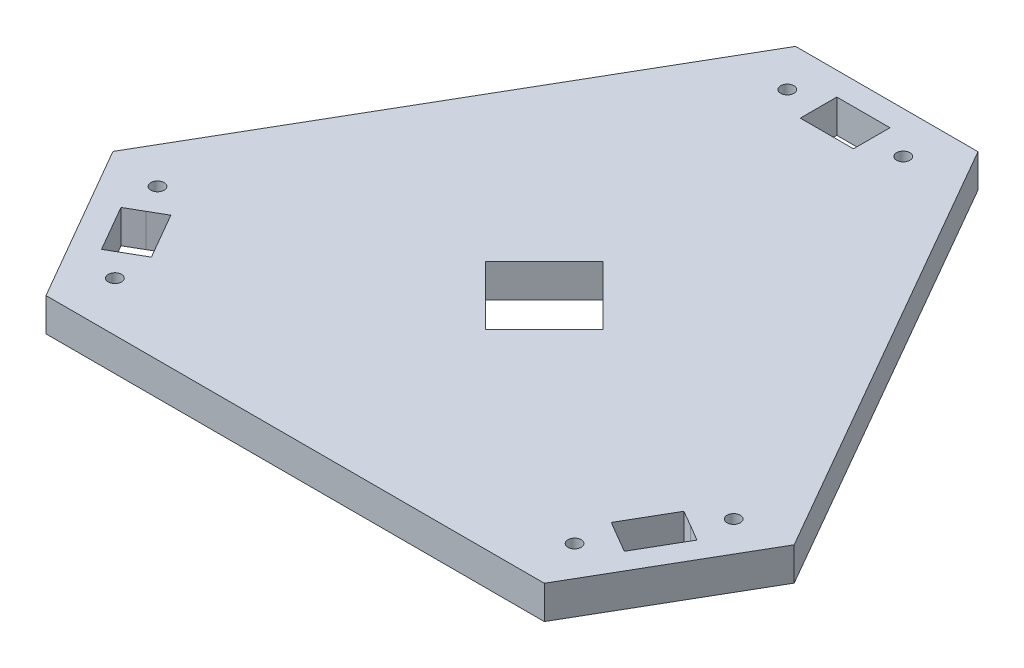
ISO-10303-21;
HEADER;
FILE_DESCRIPTION(('STEP AP214'),'2;1');
FILE_NAME('part.step','',(''),(''),'','','');
FILE_SCHEMA(('AUTOMOTIVE_DESIGN { 1 0 10303 214 1 1 1 1 }'));
ENDSEC;
DATA;
#1=APPLICATION_CONTEXT('core data for automotive mechanical design processes');
#2=APPLICATION_PROTOCOL_DEFINITION('international standard','automotive_design',2000,#1);
#3=PRODUCT_CONTEXT('',#1,'mechanical');
#4=PRODUCT('Part','Part','',(#3));
#5=PRODUCT_RELATED_PRODUCT_CATEGORY('part','',(#4));
#6=PRODUCT_DEFINITION_FORMATION('','',#4);
#7=PRODUCT_DEFINITION_CONTEXT('part definition',#1,'design');
#8=PRODUCT_DEFINITION('design','',#6,#7);
#9=PRODUCT_DEFINITION_SHAPE('','',#8);
#10=(LENGTH_UNIT() NAMED_UNIT(*) SI_UNIT(.MILLI.,.METRE.));
#11=(NAMED_UNIT(*) PLANE_ANGLE_UNIT() SI_UNIT($,.RADIAN.));
#12=(NAMED_UNIT(*) SI_UNIT($,.STERADIAN.) SOLID_ANGLE_UNIT());
#13=UNCERTAINTY_MEASURE_WITH_UNIT(LENGTH_MEASURE(1.E-05),#10,'distance_accuracy_value','');
#14=(GEOMETRIC_REPRESENTATION_CONTEXT(3) GLOBAL_UNCERTAINTY_ASSIGNED_CONTEXT((#13)) GLOBAL_UNIT_ASSIGNED_CONTEXT((#10,
#11,#12)) REPRESENTATION_CONTEXT('',''));
#15=CARTESIAN_POINT('',(0.,0.,0.));
#16=DIRECTION('',(0.,0.,1.));
#17=DIRECTION('',(1.,0.,0.));
#18=AXIS2_PLACEMENT_3D('',#15,#16,#17);
#19=CARTESIAN_POINT('',(-54.2371764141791,20.,-355.613027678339));
#20=DIRECTION('',(0.,0.,-1.));
#21=DIRECTION('',(-1.,0.,0.));
#22=AXIS2_PLACEMENT_3D('',#19,#20,#21);
#23=PLANE('',#22);
#24=DIRECTION('',(1.,0.,0.));
#25=VECTOR('',#24,1.);
#26=CARTESIAN_POINT('',(-54.2371764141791,0.,-355.613027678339));
#27=LINE('',#26,#25);
#28=CARTESIAN_POINT('',(-54.2371764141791,0.,-355.613027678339));
#29=VERTEX_POINT('',#28);
#30=CARTESIAN_POINT('',(55.5843421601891,0.,-355.613027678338));
#31=VERTEX_POINT('',#30);
#32=EDGE_CURVE('E395',#29,#31,#27,.T.);
#33=ORIENTED_EDGE('',*,*,#32,.F.);
#34=DIRECTION('',(0.,-1.,0.));
#35=VECTOR('',#34,1.);
#36=CARTESIAN_POINT('',(-54.2371764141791,20.,-355.613027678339));
#37=LINE('',#36,#35);
#38=CARTESIAN_POINT('',(-54.2371764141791,20.,-355.613027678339));
#39=VERTEX_POINT('',#38);
#40=EDGE_CURVE('E11',#39,#29,#37,.T.);
#41=ORIENTED_EDGE('',*,*,#40,.F.);
#42=DIRECTION('',(1.,0.,0.));
#43=VECTOR('',#42,1.);
#44=CARTESIAN_POINT('',(-54.2371764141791,20.,-355.613027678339));
#45=LINE('',#44,#43);
#46=CARTESIAN_POINT('',(55.5843421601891,20.,-355.613027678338));
#47=VERTEX_POINT('',#46);
#48=EDGE_CURVE('E406',#39,#47,#45,.T.);
#49=ORIENTED_EDGE('',*,*,#48,.T.);
#50=DIRECTION('',(0.,-1.,0.));
#51=VECTOR('',#50,1.);
#52=CARTESIAN_POINT('',(55.5843421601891,20.,-355.613027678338));
#53=LINE('',#52,#51);
#54=EDGE_CURVE('E35',#47,#31,#53,.T.);
#55=ORIENTED_EDGE('',*,*,#54,.T.);
#56=EDGE_LOOP('',(#33,#41,#49,#55));
#57=FACE_BOUND('',#56,.T.);
#58=ADVANCED_FACE('F32',(#57),#23,.T.);
#59=CARTESIAN_POINT('',(-54.2371764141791,20.,-355.613027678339));
#60=DIRECTION('',(0.865353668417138,0.,0.501161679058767));
#61=DIRECTION('',(0.501161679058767,0.,-0.865353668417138));
#62=AXIS2_PLACEMENT_3D('',#59,#60,#61);
#63=PLANE('',#62);
#64=DIRECTION('',(-0.501161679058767,0.,0.865353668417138));
#65=VECTOR('',#64,1.);
#66=CARTESIAN_POINT('',(-54.2371764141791,0.,-355.613027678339));
#67=LINE('',#66,#65);
#68=CARTESIAN_POINT('',(-204.994277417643,0.,-95.3014040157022));
#69=VERTEX_POINT('',#68);
#70=EDGE_CURVE('E410',#29,#69,#67,.T.);
#71=ORIENTED_EDGE('',*,*,#70,.T.);
#72=DIRECTION('',(0.,-1.,0.));
#73=VECTOR('',#72,1.);
#74=CARTESIAN_POINT('',(-204.994277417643,20.,-95.3014040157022));
#75=LINE('',#74,#73);
#76=CARTESIAN_POINT('',(-204.994277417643,20.,-95.3014040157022));
#77=VERTEX_POINT('',#76);
#78=EDGE_CURVE('E40',#77,#69,#75,.T.);
#79=ORIENTED_EDGE('',*,*,#78,.F.);
#80=DIRECTION('',(-0.501161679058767,0.,0.865353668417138));
#81=VECTOR('',#80,1.);
#82=CARTESIAN_POINT('',(-54.2371764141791,20.,-355.613027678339));
#83=LINE('',#82,#81);
#84=EDGE_CURVE('E420',#39,#77,#83,.T.);
#85=ORIENTED_EDGE('',*,*,#84,.F.);
#86=ORIENTED_EDGE('',*,*,#40,.T.);
#87=EDGE_LOOP('',(#71,#79,#85,#86));
#88=FACE_BOUND('',#87,.T.);
#89=ADVANCED_FACE('F458',(#88),#63,.F.);
#90=CARTESIAN_POINT('',(-149.988554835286,20.,0.));
#91=DIRECTION('',(-0.866090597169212,0.,0.499887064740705));
#92=DIRECTION('',(0.499887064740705,0.,0.866090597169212));
#93=AXIS2_PLACEMENT_3D('',#90,#91,#92);
#94=PLANE('',#93);
#95=DIRECTION('',(-0.499887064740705,0.,-0.866090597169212));
#96=VECTOR('',#95,1.);
#97=CARTESIAN_POINT('',(-149.988554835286,0.,0.));
#98=LINE('',#97,#96);
#99=CARTESIAN_POINT('',(-149.988554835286,0.,0.));
#100=VERTEX_POINT('',#99);
#101=EDGE_CURVE('E433',#100,#69,#98,.T.);
#102=ORIENTED_EDGE('',*,*,#101,.F.);
#103=DIRECTION('',(0.,-1.,0.));
#104=VECTOR('',#103,1.);
#105=CARTESIAN_POINT('',(-149.988554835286,20.,0.));
#106=LINE('',#105,#104);
#107=CARTESIAN_POINT('',(-149.988554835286,20.,0.));
#108=VERTEX_POINT('',#107);
#109=EDGE_CURVE('E439',#108,#100,#106,.T.);
#110=ORIENTED_EDGE('',*,*,#109,.F.);
#111=DIRECTION('',(-0.499887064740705,0.,-0.866090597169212));
#112=VECTOR('',#111,1.);
#113=CARTESIAN_POINT('',(-149.988554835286,20.,0.));
#114=LINE('',#113,#112);
#115=EDGE_CURVE('E417',#108,#77,#114,.T.);
#116=ORIENTED_EDGE('',*,*,#115,.T.);
#117=ORIENTED_EDGE('',*,*,#78,.T.);
#118=EDGE_LOOP('',(#102,#110,#116,#117));
#119=FACE_BOUND('',#118,.T.);
#120=ADVANCED_FACE('F470',(#119),#94,.T.);
#121=CARTESIAN_POINT('',(-149.988554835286,20.,0.));
#122=DIRECTION('',(0.,0.,-1.));
#123=DIRECTION('',(-1.,0.,0.));
#124=AXIS2_PLACEMENT_3D('',#121,#122,#123);
#125=PLANE('',#124);
#126=DIRECTION('',(1.,0.,0.));
#127=VECTOR('',#126,1.);
#128=CARTESIAN_POINT('',(-149.988554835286,0.,0.));
#129=LINE('',#128,#127);
#130=CARTESIAN_POINT('',(150.075497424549,0.,0.));
#131=VERTEX_POINT('',#130);
#132=EDGE_CURVE('E430',#100,#131,#129,.T.);
#133=ORIENTED_EDGE('',*,*,#132,.T.);
#134=DIRECTION('',(0.,-1.,0.));
#135=VECTOR('',#134,1.);
#136=CARTESIAN_POINT('',(150.075497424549,20.,0.));
#137=LINE('',#136,#135);
#138=CARTESIAN_POINT('',(150.075497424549,20.,0.));
#139=VERTEX_POINT('',#138);
#140=EDGE_CURVE('E441',#139,#131,#137,.T.);
#141=ORIENTED_EDGE('',*,*,#140,.F.);
#142=DIRECTION('',(1.,0.,0.));
#143=VECTOR('',#142,1.);
#144=CARTESIAN_POINT('',(-149.988554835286,20.,0.));
#145=LINE('',#144,#143);
#146=EDGE_CURVE('E415',#108,#139,#145,.T.);
#147=ORIENTED_EDGE('',*,*,#146,.F.);
#148=ORIENTED_EDGE('',*,*,#109,.T.);
#149=EDGE_LOOP('',(#133,#141,#147,#148));
#150=FACE_BOUND('',#149,.T.);
#151=ADVANCED_FACE('F471',(#150),#125,.F.);
#152=CARTESIAN_POINT('',(205.21826345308,20.,-95.3014040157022));
#153=DIRECTION('',(0.865551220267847,0.,0.500820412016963));
#154=DIRECTION('',(0.500820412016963,0.,-0.865551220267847));
#155=AXIS2_PLACEMENT_3D('',#152,#153,#154);
#156=PLANE('',#155);
#157=DIRECTION('',(-0.500820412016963,0.,0.865551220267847));
#158=VECTOR('',#157,1.);
#159=CARTESIAN_POINT('',(205.21826345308,0.,-95.3014040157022));
#160=LINE('',#159,#158);
#161=CARTESIAN_POINT('',(205.21826345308,0.,-95.3014040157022));
#162=VERTEX_POINT('',#161);
#163=EDGE_CURVE('E427',#162,#131,#160,.T.);
#164=ORIENTED_EDGE('',*,*,#163,.F.);
#165=DIRECTION('',(0.,-1.,0.));
#166=VECTOR('',#165,1.);
#167=CARTESIAN_POINT('',(205.21826345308,20.,-95.3014040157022));
#168=LINE('',#167,#166);
#169=CARTESIAN_POINT('',(205.21826345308,20.,-95.3014040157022));
#170=VERTEX_POINT('',#169);
#171=EDGE_CURVE('E442',#170,#162,#168,.T.);
#172=ORIENTED_EDGE('',*,*,#171,.F.);
#173=DIRECTION('',(-0.500820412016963,0.,0.865551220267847));
#174=VECTOR('',#173,1.);
#175=CARTESIAN_POINT('',(205.21826345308,20.,-95.3014040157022));
#176=LINE('',#175,#174);
#177=EDGE_CURVE('E412',#170,#139,#176,.T.);
#178=ORIENTED_EDGE('',*,*,#177,.T.);
#179=ORIENTED_EDGE('',*,*,#140,.T.);
#180=EDGE_LOOP('',(#164,#172,#178,#179));
#181=FACE_BOUND('',#180,.T.);
#182=ADVANCED_FACE('F467',(#181),#156,.T.);
#183=CARTESIAN_POINT('',(205.21826345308,20.,-95.3014040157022));
#184=DIRECTION('',(-0.866971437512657,0.,0.498357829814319));
#185=DIRECTION('',(0.498357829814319,0.,0.866971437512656));
#186=AXIS2_PLACEMENT_3D('',#183,#184,#185);
#187=PLANE('',#186);
#188=DIRECTION('',(-0.498357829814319,0.,-0.866971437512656));
#189=VECTOR('',#188,1.);
#190=CARTESIAN_POINT('',(205.21826345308,0.,-95.3014040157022));
#191=LINE('',#190,#189);
#192=EDGE_CURVE('E424',#162,#31,#191,.T.);
#193=ORIENTED_EDGE('',*,*,#192,.T.);
#194=ORIENTED_EDGE('',*,*,#54,.F.);
#195=DIRECTION('',(-0.498357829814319,0.,-0.866971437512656));
#196=VECTOR('',#195,1.);
#197=CARTESIAN_POINT('',(205.21826345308,20.,-95.3014040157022));
#198=LINE('',#197,#196);
#199=EDGE_CURVE('E409',#170,#47,#198,.T.);
#200=ORIENTED_EDGE('',*,*,#199,.F.);
#201=ORIENTED_EDGE('',*,*,#171,.T.);
#202=EDGE_LOOP('',(#193,#194,#200,#201));
#203=FACE_BOUND('',#202,.T.);
#204=ADVANCED_FACE('F450',(#203),#187,.F.);
#205=CARTESIAN_POINT('',(0.,20.,0.));
#206=DIRECTION('',(0.,1.,0.));
#207=DIRECTION('',(0.,0.,1.));
#208=AXIS2_PLACEMENT_3D('',#205,#206,#207);
#209=PLANE('',#208);
#210=DIRECTION('',(0.707106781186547,0.,-0.707106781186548));
#211=VECTOR('',#210,1.);
#212=CARTESIAN_POINT('',(0.,20.,-114.796112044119));
#213=LINE('',#212,#211);
#214=CARTESIAN_POINT('',(0.,20.,-114.796112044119));
#215=VERTEX_POINT('',#214);
#216=CARTESIAN_POINT('',(35.355,20.,-150.151112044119));
#217=VERTEX_POINT('',#216);
#218=EDGE_CURVE('E48',#215,#217,#213,.T.);
#219=ORIENTED_EDGE('',*,*,#218,.F.);
#220=DIRECTION('',(0.707106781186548,0.,0.707106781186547));
#221=VECTOR('',#220,1.);
#222=CARTESIAN_POINT('',(0.,20.,-114.796112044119));
#223=LINE('',#222,#221);
#224=CARTESIAN_POINT('',(-35.355,20.,-150.151112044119));
#225=VERTEX_POINT('',#224);
#226=EDGE_CURVE('E223',#225,#215,#223,.T.);
#227=ORIENTED_EDGE('',*,*,#226,.F.);
#228=DIRECTION('',(-0.707106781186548,0.,0.707106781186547));
#229=VECTOR('',#228,1.);
#230=CARTESIAN_POINT('',(-35.355,20.,-150.151112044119));
#231=LINE('',#230,#229);
#232=CARTESIAN_POINT('',(0.,20.,-185.506112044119));
#233=VERTEX_POINT('',#232);
#234=EDGE_CURVE('E226',#233,#225,#231,.T.);
#235=ORIENTED_EDGE('',*,*,#234,.F.);
#236=DIRECTION('',(-0.707106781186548,0.,-0.707106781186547));
#237=VECTOR('',#236,1.);
#238=CARTESIAN_POINT('',(35.355,20.,-150.151112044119));
#239=LINE('',#238,#237);
#240=EDGE_CURVE('E232',#217,#233,#239,.T.);
#241=ORIENTED_EDGE('',*,*,#240,.F.);
#242=EDGE_LOOP('',(#219,#227,#235,#241));
#243=FACE_BOUND('',#242,.T.);
#244=CARTESIAN_POINT('',(-138.33403120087,20.,-29.8189885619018));
#245=DIRECTION('',(0.,1.,0.));
#246=DIRECTION('',(0.,0.,1.));
#247=AXIS2_PLACEMENT_3D('',#244,#245,#246);
#248=CIRCLE('',#247,3.99999999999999);
#249=CARTESIAN_POINT('',(-138.33403120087,20.,-25.8189885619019));
#250=VERTEX_POINT('',#249);
#251=EDGE_CURVE('E238',#250,#250,#248,.T.);
#252=ORIENTED_EDGE('',*,*,#251,.F.);
#253=EDGE_LOOP('',(#252));
#254=FACE_BOUND('',#253,.T.);
#255=CARTESIAN_POINT('',(-173.344271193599,20.,-90.4767686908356));
#256=DIRECTION('',(0.,1.,0.));
#257=DIRECTION('',(0.,0.,1.));
#258=AXIS2_PLACEMENT_3D('',#255,#256,#257);
#259=CIRCLE('',#258,3.99999999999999);
#260=CARTESIAN_POINT('',(-173.344271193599,20.,-86.4767686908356));
#261=VERTEX_POINT('',#260);
#262=EDGE_CURVE('E245',#261,#261,#259,.T.);
#263=ORIENTED_EDGE('',*,*,#262,.F.);
#264=EDGE_LOOP('',(#263));
#265=FACE_BOUND('',#264,.T.);
#266=CARTESIAN_POINT('',(35.5843421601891,20.,-330.613027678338));
#267=DIRECTION('',(0.,1.,0.));
#268=DIRECTION('',(0.,0.,1.));
#269=AXIS2_PLACEMENT_3D('',#266,#267,#268);
#270=CIRCLE('',#269,4.00000000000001);
#271=CARTESIAN_POINT('',(35.5843421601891,20.,-326.613027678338));
#272=VERTEX_POINT('',#271);
#273=EDGE_CURVE('E251',#272,#272,#270,.T.);
#274=ORIENTED_EDGE('',*,*,#273,.F.);
#275=EDGE_LOOP('',(#274));
#276=FACE_BOUND('',#275,.T.);
#277=CARTESIAN_POINT('',(-34.2371764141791,20.,-330.613027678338));
#278=DIRECTION('',(0.,1.,0.));
#279=DIRECTION('',(0.,0.,1.));
#280=AXIS2_PLACEMENT_3D('',#277,#278,#279);
#281=CIRCLE('',#280,4.);
#282=CARTESIAN_POINT('',(-34.2371764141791,20.,-326.613027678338));
#283=VERTEX_POINT('',#282);
#284=EDGE_CURVE('E257',#283,#283,#281,.T.);
#285=ORIENTED_EDGE('',*,*,#284,.F.);
#286=EDGE_LOOP('',(#285));
#287=FACE_BOUND('',#286,.T.);
#288=CARTESIAN_POINT('',(138.453125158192,20.,-29.831534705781));
#289=DIRECTION('',(0.,1.,0.));
#290=DIRECTION('',(0.,0.,1.));
#291=AXIS2_PLACEMENT_3D('',#288,#289,#290);
#292=CIRCLE('',#291,3.99999999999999);
#293=CARTESIAN_POINT('',(138.453125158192,20.,-25.831534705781));
#294=VERTEX_POINT('',#293);
#295=EDGE_CURVE('E263',#294,#294,#292,.T.);
#296=ORIENTED_EDGE('',*,*,#295,.F.);
#297=EDGE_LOOP('',(#296));
#298=FACE_BOUND('',#297,.T.);
#299=CARTESIAN_POINT('',(173.563074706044,20.,-90.5108899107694));
#300=DIRECTION('',(0.,1.,0.));
#301=DIRECTION('',(0.,0.,1.));
#302=AXIS2_PLACEMENT_3D('',#299,#300,#301);
#303=CIRCLE('',#302,3.99999999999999);
#304=CARTESIAN_POINT('',(173.563074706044,20.,-86.5108899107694));
#305=VERTEX_POINT('',#304);
#306=EDGE_CURVE('E269',#305,#305,#303,.T.);
#307=ORIENTED_EDGE('',*,*,#306,.F.);
#308=EDGE_LOOP('',(#307));
#309=FACE_BOUND('',#308,.T.);
#310=DIRECTION('',(-1.,0.,0.));
#311=VECTOR('',#310,1.);
#312=CARTESIAN_POINT('',(16.5843421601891,20.,-341.613027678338));
#313=LINE('',#312,#311);
#314=CARTESIAN_POINT('',(16.5843421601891,20.,-341.613027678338));
#315=VERTEX_POINT('',#314);
#316=CARTESIAN_POINT('',(-15.4156578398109,20.,-341.613027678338));
#317=VERTEX_POINT('',#316);
#318=EDGE_CURVE('E282',#315,#317,#313,.T.);
#319=ORIENTED_EDGE('',*,*,#318,.F.);
#320=DIRECTION('',(0.,0.,-1.));
#321=VECTOR('',#320,1.);
#322=CARTESIAN_POINT('',(16.5843421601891,20.,-319.613027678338));
#323=LINE('',#322,#321);
#324=CARTESIAN_POINT('',(16.5843421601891,20.,-319.613027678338));
#325=VERTEX_POINT('',#324);
#326=EDGE_CURVE('E297',#325,#315,#323,.T.);
#327=ORIENTED_EDGE('',*,*,#326,.F.);
#328=DIRECTION('',(1.,0.,0.));
#329=VECTOR('',#328,1.);
#330=CARTESIAN_POINT('',(-15.4156578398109,20.,-319.613027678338));
#331=LINE('',#330,#329);
#332=CARTESIAN_POINT('',(-15.4156578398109,20.,-319.613027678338));
#333=VERTEX_POINT('',#332);
#334=EDGE_CURVE('E294',#333,#325,#331,.T.);
#335=ORIENTED_EDGE('',*,*,#334,.F.);
#336=DIRECTION('',(0.,0.,1.));
#337=VECTOR('',#336,1.);
#338=CARTESIAN_POINT('',(-15.4156578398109,20.,-330.613027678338));
#339=LINE('',#338,#337);
#340=EDGE_CURVE('E275',#317,#333,#339,.T.);
#341=ORIENTED_EDGE('',*,*,#340,.F.);
#342=EDGE_LOOP('',(#319,#327,#335,#341));
#343=FACE_BOUND('',#342,.T.);
#344=DIRECTION('',(-0.860737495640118,0.,-0.509049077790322));
#345=VECTOR('',#344,1.);
#346=CARTESIAN_POINT('',(173.516029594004,20.,-68.4656224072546));
#347=LINE('',#346,#345);
#348=CARTESIAN_POINT('',(173.516029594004,20.,-68.4656224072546));
#349=VERTEX_POINT('',#348);
#350=CARTESIAN_POINT('',(164.047486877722,20.,-74.0654167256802));
#351=VERTEX_POINT('',#350);
#352=EDGE_CURVE('E304',#349,#351,#347,.T.);
#353=ORIENTED_EDGE('',*,*,#352,.F.);
#354=DIRECTION('',(0.500820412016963,0.,-0.865551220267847));
#355=VECTOR('',#354,1.);
#356=CARTESIAN_POINT('',(157.489776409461,20.,-40.7679833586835));
#357=LINE('',#356,#355);
#358=CARTESIAN_POINT('',(157.489776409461,20.,-40.7679833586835));
#359=VERTEX_POINT('',#358);
#360=EDGE_CURVE('E314',#359,#349,#357,.T.);
#361=ORIENTED_EDGE('',*,*,#360,.F.);
#362=DIRECTION('',(0.865551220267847,0.,0.500820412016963));
#363=VECTOR('',#362,1.);
#364=CARTESIAN_POINT('',(147.968712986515,20.,-46.2770078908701));
#365=LINE('',#364,#363);
#366=CARTESIAN_POINT('',(147.968712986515,20.,-46.2770078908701));
#367=VERTEX_POINT('',#366);
#368=EDGE_CURVE('E340',#367,#359,#365,.T.);
#369=ORIENTED_EDGE('',*,*,#368,.F.);
#370=DIRECTION('',(0.860737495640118,0.,0.509049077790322));
#371=VECTOR('',#370,1.);
#372=CARTESIAN_POINT('',(138.500170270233,20.,-51.8768022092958));
#373=LINE('',#372,#371);
#374=CARTESIAN_POINT('',(138.500170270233,20.,-51.8768022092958));
#375=VERTEX_POINT('',#374);
#376=EDGE_CURVE('E337',#375,#367,#373,.T.);
#377=ORIENTED_EDGE('',*,*,#376,.F.);
#378=DIRECTION('',(-0.500820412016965,0.,0.865551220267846));
#379=VECTOR('',#378,1.);
#380=CARTESIAN_POINT('',(154.526423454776,20.,-79.5744412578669));
#381=LINE('',#380,#379);
#382=CARTESIAN_POINT('',(154.526423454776,20.,-79.5744412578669));
#383=VERTEX_POINT('',#382);
#384=EDGE_CURVE('E334',#383,#375,#381,.T.);
#385=ORIENTED_EDGE('',*,*,#384,.F.);
#386=DIRECTION('',(-0.865551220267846,0.,-0.500820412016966));
#387=VECTOR('',#386,1.);
#388=CARTESIAN_POINT('',(164.047486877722,20.,-74.0654167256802));
#389=LINE('',#388,#387);
#390=EDGE_CURVE('E331',#351,#383,#389,.T.);
#391=ORIENTED_EDGE('',*,*,#390,.F.);
#392=EDGE_LOOP('',(#353,#361,#369,#377,#385,#391));
#393=FACE_BOUND('',#392,.T.);
#394=DIRECTION('',(-0.499887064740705,0.,-0.866090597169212));
#395=VECTOR('',#394,1.);
#396=CARTESIAN_POINT('',(-138.304888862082,20.,-51.7734676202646));
#397=LINE('',#396,#395);
#398=CARTESIAN_POINT('',(-138.304888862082,20.,-51.7734676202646));
#399=VERTEX_POINT('',#398);
#400=CARTESIAN_POINT('',(-154.301274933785,20.,-79.4883667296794));
#401=VERTEX_POINT('',#400);
#402=EDGE_CURVE('E347',#399,#401,#397,.T.);
#403=ORIENTED_EDGE('',*,*,#402,.F.);
#404=DIRECTION('',(0.866090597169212,0.,-0.499887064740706));
#405=VECTOR('',#404,1.);
#406=CARTESIAN_POINT('',(-147.831885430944,20.,-46.2747099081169));
#407=LINE('',#406,#405);
#408=CARTESIAN_POINT('',(-147.831885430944,20.,-46.2747099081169));
#409=VERTEX_POINT('',#408);
#410=EDGE_CURVE('E362',#409,#399,#407,.T.);
#411=ORIENTED_EDGE('',*,*,#410,.F.);
#412=DIRECTION('',(0.867735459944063,0.,-0.497026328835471));
#413=VECTOR('',#412,1.);
#414=CARTESIAN_POINT('',(-157.377027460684,20.,-40.807390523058));
#415=LINE('',#414,#413);
#416=CARTESIAN_POINT('',(-157.377027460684,20.,-40.807390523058));
#417=VERTEX_POINT('',#416);
#418=EDGE_CURVE('E388',#417,#409,#415,.T.);
#419=ORIENTED_EDGE('',*,*,#418,.F.);
#420=DIRECTION('',(0.499887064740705,0.,0.866090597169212));
#421=VECTOR('',#420,1.);
#422=CARTESIAN_POINT('',(-173.373413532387,20.,-68.5222896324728));
#423=LINE('',#422,#421);
#424=CARTESIAN_POINT('',(-173.373413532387,20.,-68.5222896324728));
#425=VERTEX_POINT('',#424);
#426=EDGE_CURVE('E385',#425,#417,#423,.T.);
#427=ORIENTED_EDGE('',*,*,#426,.F.);
#428=DIRECTION('',(-0.866090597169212,0.,0.499887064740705));
#429=VECTOR('',#428,1.);
#430=CARTESIAN_POINT('',(-163.846416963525,20.,-74.0210473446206));
#431=LINE('',#430,#429);
#432=CARTESIAN_POINT('',(-163.846416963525,20.,-74.0210473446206));
#433=VERTEX_POINT('',#432);
#434=EDGE_CURVE('E382',#433,#425,#431,.T.);
#435=ORIENTED_EDGE('',*,*,#434,.F.);
#436=DIRECTION('',(-0.867735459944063,0.,0.49702632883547));
#437=VECTOR('',#436,1.);
#438=CARTESIAN_POINT('',(-154.301274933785,20.,-79.4883667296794));
#439=LINE('',#438,#437);
#440=EDGE_CURVE('E379',#401,#433,#439,.T.);
#441=ORIENTED_EDGE('',*,*,#440,.F.);
#442=EDGE_LOOP('',(#403,#411,#419,#427,#435,#441));
#443=FACE_BOUND('',#442,.T.);
#444=ORIENTED_EDGE('',*,*,#48,.F.);
#445=ORIENTED_EDGE('',*,*,#84,.T.);
#446=ORIENTED_EDGE('',*,*,#115,.F.);
#447=ORIENTED_EDGE('',*,*,#146,.T.);
#448=ORIENTED_EDGE('',*,*,#177,.F.);
#449=ORIENTED_EDGE('',*,*,#199,.T.);
#450=EDGE_LOOP('',(#444,#445,#446,#447,#448,#449));
#451=FACE_BOUND('',#450,.T.);
#452=ADVANCED_FACE('F462',(#243,#254,#265,#276,#287,#298,#309,#343,#393,#443,#451),#209,.T.);
#453=CARTESIAN_POINT('',(0.,0.,0.));
#454=DIRECTION('',(0.,1.,0.));
#455=DIRECTION('',(0.,0.,1.));
#456=AXIS2_PLACEMENT_3D('',#453,#454,#455);
#457=PLANE('',#456);
#458=DIRECTION('',(0.707106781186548,0.,0.707106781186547));
#459=VECTOR('',#458,1.);
#460=CARTESIAN_POINT('',(0.,0.,-114.796112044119));
#461=LINE('',#460,#459);
#462=CARTESIAN_POINT('',(-35.355,0.,-150.151112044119));
#463=VERTEX_POINT('',#462);
#464=CARTESIAN_POINT('',(0.,0.,-114.796112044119));
#465=VERTEX_POINT('',#464);
#466=EDGE_CURVE('E213',#463,#465,#461,.T.);
#467=ORIENTED_EDGE('',*,*,#466,.T.);
#468=DIRECTION('',(0.707106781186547,0.,-0.707106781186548));
#469=VECTOR('',#468,1.);
#470=CARTESIAN_POINT('',(0.,0.,-114.796112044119));
#471=LINE('',#470,#469);
#472=CARTESIAN_POINT('',(35.355,0.,-150.151112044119));
#473=VERTEX_POINT('',#472);
#474=EDGE_CURVE('E207',#465,#473,#471,.T.);
#475=ORIENTED_EDGE('',*,*,#474,.T.);
#476=DIRECTION('',(-0.707106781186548,0.,-0.707106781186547));
#477=VECTOR('',#476,1.);
#478=CARTESIAN_POINT('',(35.355,0.,-150.151112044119));
#479=LINE('',#478,#477);
#480=CARTESIAN_POINT('',(0.,0.,-185.506112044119));
#481=VERTEX_POINT('',#480);
#482=EDGE_CURVE('E216',#473,#481,#479,.T.);
#483=ORIENTED_EDGE('',*,*,#482,.T.);
#484=DIRECTION('',(-0.707106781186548,0.,0.707106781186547));
#485=VECTOR('',#484,1.);
#486=CARTESIAN_POINT('',(-35.355,0.,-150.151112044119));
#487=LINE('',#486,#485);
#488=EDGE_CURVE('E56',#481,#463,#487,.T.);
#489=ORIENTED_EDGE('',*,*,#488,.T.);
#490=EDGE_LOOP('',(#467,#475,#483,#489));
#491=FACE_BOUND('',#490,.T.);
#492=DIRECTION('',(0.,0.,-1.));
#493=VECTOR('',#492,1.);
#494=CARTESIAN_POINT('',(16.5843421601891,0.,-319.613027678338));
#495=LINE('',#494,#493);
#496=CARTESIAN_POINT('',(16.5843421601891,0.,-319.613027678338));
#497=VERTEX_POINT('',#496);
#498=CARTESIAN_POINT('',(16.5843421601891,0.,-341.613027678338));
#499=VERTEX_POINT('',#498);
#500=EDGE_CURVE('E285',#497,#499,#495,.T.);
#501=ORIENTED_EDGE('',*,*,#500,.T.);
#502=DIRECTION('',(-1.,0.,0.));
#503=VECTOR('',#502,1.);
#504=CARTESIAN_POINT('',(16.5843421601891,0.,-341.613027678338));
#505=LINE('',#504,#503);
#506=CARTESIAN_POINT('',(-15.4156578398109,0.,-341.613027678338));
#507=VERTEX_POINT('',#506);
#508=EDGE_CURVE('E288',#499,#507,#505,.T.);
#509=ORIENTED_EDGE('',*,*,#508,.T.);
#510=DIRECTION('',(0.,0.,1.));
#511=VECTOR('',#510,1.);
#512=CARTESIAN_POINT('',(-15.4156578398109,0.,-341.613027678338));
#513=LINE('',#512,#511);
#514=CARTESIAN_POINT('',(-15.4156578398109,0.,-319.613027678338));
#515=VERTEX_POINT('',#514);
#516=EDGE_CURVE('E278',#507,#515,#513,.T.);
#517=ORIENTED_EDGE('',*,*,#516,.T.);
#518=DIRECTION('',(1.,0.,0.));
#519=VECTOR('',#518,1.);
#520=CARTESIAN_POINT('',(-15.4156578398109,0.,-319.613027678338));
#521=LINE('',#520,#519);
#522=EDGE_CURVE('E281',#515,#497,#521,.T.);
#523=ORIENTED_EDGE('',*,*,#522,.T.);
#524=EDGE_LOOP('',(#501,#509,#517,#523));
#525=FACE_BOUND('',#524,.T.);
#526=DIRECTION('',(0.500820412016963,0.,-0.865551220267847));
#527=VECTOR('',#526,1.);
#528=CARTESIAN_POINT('',(157.489776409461,0.,-40.7679833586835));
#529=LINE('',#528,#527);
#530=CARTESIAN_POINT('',(157.489776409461,0.,-40.7679833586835));
#531=VERTEX_POINT('',#530);
#532=CARTESIAN_POINT('',(173.516029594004,0.,-68.4656224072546));
#533=VERTEX_POINT('',#532);
#534=EDGE_CURVE('E326',#531,#533,#529,.T.);
#535=ORIENTED_EDGE('',*,*,#534,.T.);
#536=DIRECTION('',(-0.860737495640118,0.,-0.509049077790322));
#537=VECTOR('',#536,1.);
#538=CARTESIAN_POINT('',(173.516029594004,0.,-68.4656224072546));
#539=LINE('',#538,#537);
#540=CARTESIAN_POINT('',(164.047486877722,0.,-74.0654167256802));
#541=VERTEX_POINT('',#540);
#542=EDGE_CURVE('E310',#533,#541,#539,.T.);
#543=ORIENTED_EDGE('',*,*,#542,.T.);
#544=DIRECTION('',(-0.865551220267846,0.,-0.500820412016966));
#545=VECTOR('',#544,1.);
#546=CARTESIAN_POINT('',(164.047486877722,0.,-74.0654167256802));
#547=LINE('',#546,#545);
#548=CARTESIAN_POINT('',(154.526423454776,0.,-79.5744412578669));
#549=VERTEX_POINT('',#548);
#550=EDGE_CURVE('E313',#541,#549,#547,.T.);
#551=ORIENTED_EDGE('',*,*,#550,.T.);
#552=DIRECTION('',(-0.500820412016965,0.,0.865551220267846));
#553=VECTOR('',#552,1.);
#554=CARTESIAN_POINT('',(154.526423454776,0.,-79.5744412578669));
#555=LINE('',#554,#553);
#556=CARTESIAN_POINT('',(138.500170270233,0.,-51.8768022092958));
#557=VERTEX_POINT('',#556);
#558=EDGE_CURVE('E317',#549,#557,#555,.T.);
#559=ORIENTED_EDGE('',*,*,#558,.T.);
#560=DIRECTION('',(0.860737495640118,0.,0.509049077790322));
#561=VECTOR('',#560,1.);
#562=CARTESIAN_POINT('',(138.500170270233,0.,-51.8768022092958));
#563=LINE('',#562,#561);
#564=CARTESIAN_POINT('',(147.968712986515,0.,-46.2770078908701));
#565=VERTEX_POINT('',#564);
#566=EDGE_CURVE('E320',#557,#565,#563,.T.);
#567=ORIENTED_EDGE('',*,*,#566,.T.);
#568=DIRECTION('',(0.865551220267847,0.,0.500820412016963));
#569=VECTOR('',#568,1.);
#570=CARTESIAN_POINT('',(147.968712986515,0.,-46.2770078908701));
#571=LINE('',#570,#569);
#572=EDGE_CURVE('E323',#565,#531,#571,.T.);
#573=ORIENTED_EDGE('',*,*,#572,.T.);
#574=EDGE_LOOP('',(#535,#543,#551,#559,#567,#573));
#575=FACE_BOUND('',#574,.T.);
#576=DIRECTION('',(0.866090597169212,0.,-0.499887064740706));
#577=VECTOR('',#576,1.);
#578=CARTESIAN_POINT('',(-147.831885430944,0.,-46.2747099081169));
#579=LINE('',#578,#577);
#580=CARTESIAN_POINT('',(-147.831885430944,0.,-46.2747099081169));
#581=VERTEX_POINT('',#580);
#582=CARTESIAN_POINT('',(-138.304888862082,0.,-51.7734676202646));
#583=VERTEX_POINT('',#582);
#584=EDGE_CURVE('E374',#581,#583,#579,.T.);
#585=ORIENTED_EDGE('',*,*,#584,.T.);
#586=DIRECTION('',(-0.499887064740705,0.,-0.866090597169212));
#587=VECTOR('',#586,1.);
#588=CARTESIAN_POINT('',(-138.304888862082,0.,-51.7734676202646));
#589=LINE('',#588,#587);
#590=CARTESIAN_POINT('',(-154.301274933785,0.,-79.4883667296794));
#591=VERTEX_POINT('',#590);
#592=EDGE_CURVE('E358',#583,#591,#589,.T.);
#593=ORIENTED_EDGE('',*,*,#592,.T.);
#594=DIRECTION('',(-0.867735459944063,0.,0.49702632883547));
#595=VECTOR('',#594,1.);
#596=CARTESIAN_POINT('',(-154.301274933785,0.,-79.4883667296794));
#597=LINE('',#596,#595);
#598=CARTESIAN_POINT('',(-163.846416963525,0.,-74.0210473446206));
#599=VERTEX_POINT('',#598);
#600=EDGE_CURVE('E361',#591,#599,#597,.T.);
#601=ORIENTED_EDGE('',*,*,#600,.T.);
#602=DIRECTION('',(-0.866090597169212,0.,0.499887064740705));
#603=VECTOR('',#602,1.);
#604=CARTESIAN_POINT('',(-163.846416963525,0.,-74.0210473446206));
#605=LINE('',#604,#603);
#606=CARTESIAN_POINT('',(-173.373413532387,0.,-68.5222896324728));
#607=VERTEX_POINT('',#606);
#608=EDGE_CURVE('E365',#599,#607,#605,.T.);
#609=ORIENTED_EDGE('',*,*,#608,.T.);
#610=DIRECTION('',(0.499887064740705,0.,0.866090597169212));
#611=VECTOR('',#610,1.);
#612=CARTESIAN_POINT('',(-173.373413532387,0.,-68.5222896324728));
#613=LINE('',#612,#611);
#614=CARTESIAN_POINT('',(-157.377027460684,0.,-40.807390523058));
#615=VERTEX_POINT('',#614);
#616=EDGE_CURVE('E368',#607,#615,#613,.T.);
#617=ORIENTED_EDGE('',*,*,#616,.T.);
#618=DIRECTION('',(0.867735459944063,0.,-0.497026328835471));
#619=VECTOR('',#618,1.);
#620=CARTESIAN_POINT('',(-157.377027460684,0.,-40.807390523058));
#621=LINE('',#620,#619);
#622=EDGE_CURVE('E371',#615,#581,#621,.T.);
#623=ORIENTED_EDGE('',*,*,#622,.T.);
#624=EDGE_LOOP('',(#585,#593,#601,#609,#617,#623));
#625=FACE_BOUND('',#624,.T.);
#626=ORIENTED_EDGE('',*,*,#32,.T.);
#627=ORIENTED_EDGE('',*,*,#192,.F.);
#628=ORIENTED_EDGE('',*,*,#163,.T.);
#629=ORIENTED_EDGE('',*,*,#132,.F.);
#630=ORIENTED_EDGE('',*,*,#101,.T.);
#631=ORIENTED_EDGE('',*,*,#70,.F.);
#632=EDGE_LOOP('',(#626,#627,#628,#629,#630,#631));
#633=FACE_BOUND('',#632,.T.);
#634=ADVANCED_FACE('F220',(#491,#525,#575,#625,#633),#457,.F.);
#635=CARTESIAN_POINT('',(-138.304888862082,0.,-51.7734676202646));
#636=DIRECTION('',(0.866090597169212,0.,-0.499887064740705));
#637=DIRECTION('',(-0.499887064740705,0.,-0.866090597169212));
#638=AXIS2_PLACEMENT_3D('',#635,#636,#637);
#639=PLANE('',#638);
#640=ORIENTED_EDGE('',*,*,#402,.T.);
#641=DIRECTION('',(0.,1.,0.));
#642=VECTOR('',#641,1.);
#643=CARTESIAN_POINT('',(-154.301274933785,0.,-79.4883667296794));
#644=LINE('',#643,#642);
#645=EDGE_CURVE('E377',#591,#401,#644,.T.);
#646=ORIENTED_EDGE('',*,*,#645,.F.);
#647=ORIENTED_EDGE('',*,*,#592,.F.);
#648=DIRECTION('',(0.,1.,0.));
#649=VECTOR('',#648,1.);
#650=CARTESIAN_POINT('',(-138.304888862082,0.,-51.7734676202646));
#651=LINE('',#650,#649);
#652=EDGE_CURVE('E393',#583,#399,#651,.T.);
#653=ORIENTED_EDGE('',*,*,#652,.T.);
#654=EDGE_LOOP('',(#640,#646,#647,#653));
#655=FACE_BOUND('',#654,.T.);
#656=ADVANCED_FACE('F490',(#655),#639,.F.);
#657=CARTESIAN_POINT('',(-147.831885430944,0.,-46.2747099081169));
#658=DIRECTION('',(0.499887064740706,0.,0.866090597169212));
#659=DIRECTION('',(0.866090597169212,0.,-0.499887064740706));
#660=AXIS2_PLACEMENT_3D('',#657,#658,#659);
#661=PLANE('',#660);
#662=ORIENTED_EDGE('',*,*,#410,.T.);
#663=ORIENTED_EDGE('',*,*,#652,.F.);
#664=ORIENTED_EDGE('',*,*,#584,.F.);
#665=DIRECTION('',(0.,1.,0.));
#666=VECTOR('',#665,1.);
#667=CARTESIAN_POINT('',(-147.831885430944,0.,-46.2747099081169));
#668=LINE('',#667,#666);
#669=EDGE_CURVE('E396',#581,#409,#668,.T.);
#670=ORIENTED_EDGE('',*,*,#669,.T.);
#671=EDGE_LOOP('',(#662,#663,#664,#670));
#672=FACE_BOUND('',#671,.T.);
#673=ADVANCED_FACE('F496',(#672),#661,.F.);
#674=CARTESIAN_POINT('',(-157.377027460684,0.,-40.807390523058));
#675=DIRECTION('',(0.497026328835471,0.,0.867735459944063));
#676=DIRECTION('',(0.867735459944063,0.,-0.497026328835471));
#677=AXIS2_PLACEMENT_3D('',#674,#675,#676);
#678=PLANE('',#677);
#679=ORIENTED_EDGE('',*,*,#418,.T.);
#680=ORIENTED_EDGE('',*,*,#669,.F.);
#681=ORIENTED_EDGE('',*,*,#622,.F.);
#682=DIRECTION('',(0.,1.,0.));
#683=VECTOR('',#682,1.);
#684=CARTESIAN_POINT('',(-157.377027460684,0.,-40.807390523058));
#685=LINE('',#684,#683);
#686=EDGE_CURVE('E398',#615,#417,#685,.T.);
#687=ORIENTED_EDGE('',*,*,#686,.T.);
#688=EDGE_LOOP('',(#679,#680,#681,#687));
#689=FACE_BOUND('',#688,.T.);
#690=ADVANCED_FACE('F510',(#689),#678,.F.);
#691=CARTESIAN_POINT('',(-173.373413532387,0.,-68.5222896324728));
#692=DIRECTION('',(-0.866090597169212,0.,0.499887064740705));
#693=DIRECTION('',(0.499887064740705,0.,0.866090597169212));
#694=AXIS2_PLACEMENT_3D('',#691,#692,#693);
#695=PLANE('',#694);
#696=ORIENTED_EDGE('',*,*,#426,.T.);
#697=ORIENTED_EDGE('',*,*,#686,.F.);
#698=ORIENTED_EDGE('',*,*,#616,.F.);
#699=DIRECTION('',(0.,1.,0.));
#700=VECTOR('',#699,1.);
#701=CARTESIAN_POINT('',(-173.373413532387,0.,-68.5222896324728));
#702=LINE('',#701,#700);
#703=EDGE_CURVE('E400',#607,#425,#702,.T.);
#704=ORIENTED_EDGE('',*,*,#703,.T.);
#705=EDGE_LOOP('',(#696,#697,#698,#704));
#706=FACE_BOUND('',#705,.T.);
#707=ADVANCED_FACE('F506',(#706),#695,.F.);
#708=CARTESIAN_POINT('',(-163.846416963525,0.,-74.0210473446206));
#709=DIRECTION('',(-0.499887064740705,0.,-0.866090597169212));
#710=DIRECTION('',(-0.866090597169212,0.,0.499887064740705));
#711=AXIS2_PLACEMENT_3D('',#708,#709,#710);
#712=PLANE('',#711);
#713=ORIENTED_EDGE('',*,*,#434,.T.);
#714=ORIENTED_EDGE('',*,*,#703,.F.);
#715=ORIENTED_EDGE('',*,*,#608,.F.);
#716=DIRECTION('',(0.,1.,0.));
#717=VECTOR('',#716,1.);
#718=CARTESIAN_POINT('',(-163.846416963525,0.,-74.0210473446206));
#719=LINE('',#718,#717);
#720=EDGE_CURVE('E402',#599,#433,#719,.T.);
#721=ORIENTED_EDGE('',*,*,#720,.T.);
#722=EDGE_LOOP('',(#713,#714,#715,#721));
#723=FACE_BOUND('',#722,.T.);
#724=ADVANCED_FACE('F502',(#723),#712,.F.);
#725=CARTESIAN_POINT('',(-154.301274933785,0.,-79.4883667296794));
#726=DIRECTION('',(-0.49702632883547,0.,-0.867735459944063));
#727=DIRECTION('',(-0.867735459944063,0.,0.49702632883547));
#728=AXIS2_PLACEMENT_3D('',#725,#726,#727);
#729=PLANE('',#728);
#730=ORIENTED_EDGE('',*,*,#440,.T.);
#731=ORIENTED_EDGE('',*,*,#720,.F.);
#732=ORIENTED_EDGE('',*,*,#600,.F.);
#733=ORIENTED_EDGE('',*,*,#645,.T.);
#734=EDGE_LOOP('',(#730,#731,#732,#733));
#735=FACE_BOUND('',#734,.T.);
#736=ADVANCED_FACE('F498',(#735),#729,.F.);
#737=CARTESIAN_POINT('',(173.516029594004,0.,-68.4656224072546));
#738=DIRECTION('',(0.509049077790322,0.,-0.860737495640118));
#739=DIRECTION('',(-0.860737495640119,0.,-0.509049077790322));
#740=AXIS2_PLACEMENT_3D('',#737,#738,#739);
#741=PLANE('',#740);
#742=ORIENTED_EDGE('',*,*,#352,.T.);
#743=DIRECTION('',(0.,1.,0.));
#744=VECTOR('',#743,1.);
#745=CARTESIAN_POINT('',(164.047486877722,0.,-74.0654167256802));
#746=LINE('',#745,#744);
#747=EDGE_CURVE('E329',#541,#351,#746,.T.);
#748=ORIENTED_EDGE('',*,*,#747,.F.);
#749=ORIENTED_EDGE('',*,*,#542,.F.);
#750=DIRECTION('',(0.,1.,0.));
#751=VECTOR('',#750,1.);
#752=CARTESIAN_POINT('',(173.516029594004,0.,-68.4656224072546));
#753=LINE('',#752,#751);
#754=EDGE_CURVE('E345',#533,#349,#753,.T.);
#755=ORIENTED_EDGE('',*,*,#754,.T.);
#756=EDGE_LOOP('',(#742,#748,#749,#755));
#757=FACE_BOUND('',#756,.T.);
#758=ADVANCED_FACE('F501',(#757),#741,.F.);
#759=CARTESIAN_POINT('',(157.489776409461,0.,-40.7679833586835));
#760=DIRECTION('',(0.865551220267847,0.,0.500820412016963));
#761=DIRECTION('',(0.500820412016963,0.,-0.865551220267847));
#762=AXIS2_PLACEMENT_3D('',#759,#760,#761);
#763=PLANE('',#762);
#764=ORIENTED_EDGE('',*,*,#360,.T.);
#765=ORIENTED_EDGE('',*,*,#754,.F.);
#766=ORIENTED_EDGE('',*,*,#534,.F.);
#767=DIRECTION('',(0.,1.,0.));
#768=VECTOR('',#767,1.);
#769=CARTESIAN_POINT('',(157.489776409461,0.,-40.7679833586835));
#770=LINE('',#769,#768);
#771=EDGE_CURVE('E348',#531,#359,#770,.T.);
#772=ORIENTED_EDGE('',*,*,#771,.T.);
#773=EDGE_LOOP('',(#764,#765,#766,#772));
#774=FACE_BOUND('',#773,.T.);
#775=ADVANCED_FACE('F520',(#774),#763,.F.);
#776=CARTESIAN_POINT('',(147.968712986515,0.,-46.2770078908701));
#777=DIRECTION('',(-0.500820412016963,0.,0.865551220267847));
#778=DIRECTION('',(0.865551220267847,0.,0.500820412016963));
#779=AXIS2_PLACEMENT_3D('',#776,#777,#778);
#780=PLANE('',#779);
#781=ORIENTED_EDGE('',*,*,#368,.T.);
#782=ORIENTED_EDGE('',*,*,#771,.F.);
#783=ORIENTED_EDGE('',*,*,#572,.F.);
#784=DIRECTION('',(0.,1.,0.));
#785=VECTOR('',#784,1.);
#786=CARTESIAN_POINT('',(147.968712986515,0.,-46.2770078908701));
#787=LINE('',#786,#785);
#788=EDGE_CURVE('E350',#565,#367,#787,.T.);
#789=ORIENTED_EDGE('',*,*,#788,.T.);
#790=EDGE_LOOP('',(#781,#782,#783,#789));
#791=FACE_BOUND('',#790,.T.);
#792=ADVANCED_FACE('F534',(#791),#780,.F.);
#793=CARTESIAN_POINT('',(138.500170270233,0.,-51.8768022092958));
#794=DIRECTION('',(-0.509049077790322,0.,0.860737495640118));
#795=DIRECTION('',(0.860737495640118,0.,0.509049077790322));
#796=AXIS2_PLACEMENT_3D('',#793,#794,#795);
#797=PLANE('',#796);
#798=ORIENTED_EDGE('',*,*,#376,.T.);
#799=ORIENTED_EDGE('',*,*,#788,.F.);
#800=ORIENTED_EDGE('',*,*,#566,.F.);
#801=DIRECTION('',(0.,1.,0.));
#802=VECTOR('',#801,1.);
#803=CARTESIAN_POINT('',(138.500170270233,0.,-51.8768022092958));
#804=LINE('',#803,#802);
#805=EDGE_CURVE('E352',#557,#375,#804,.T.);
#806=ORIENTED_EDGE('',*,*,#805,.T.);
#807=EDGE_LOOP('',(#798,#799,#800,#806));
#808=FACE_BOUND('',#807,.T.);
#809=ADVANCED_FACE('F530',(#808),#797,.F.);
#810=CARTESIAN_POINT('',(154.526423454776,0.,-79.5744412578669));
#811=DIRECTION('',(-0.865551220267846,0.,-0.500820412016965));
#812=DIRECTION('',(-0.500820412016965,0.,0.865551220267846));
#813=AXIS2_PLACEMENT_3D('',#810,#811,#812);
#814=PLANE('',#813);
#815=ORIENTED_EDGE('',*,*,#384,.T.);
#816=ORIENTED_EDGE('',*,*,#805,.F.);
#817=ORIENTED_EDGE('',*,*,#558,.F.);
#818=DIRECTION('',(0.,1.,0.));
#819=VECTOR('',#818,1.);
#820=CARTESIAN_POINT('',(154.526423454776,0.,-79.5744412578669));
#821=LINE('',#820,#819);
#822=EDGE_CURVE('E354',#549,#383,#821,.T.);
#823=ORIENTED_EDGE('',*,*,#822,.T.);
#824=EDGE_LOOP('',(#815,#816,#817,#823));
#825=FACE_BOUND('',#824,.T.);
#826=ADVANCED_FACE('F526',(#825),#814,.F.);
#827=CARTESIAN_POINT('',(164.047486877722,0.,-74.0654167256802));
#828=DIRECTION('',(0.500820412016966,0.,-0.865551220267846));
#829=DIRECTION('',(-0.865551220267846,0.,-0.500820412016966));
#830=AXIS2_PLACEMENT_3D('',#827,#828,#829);
#831=PLANE('',#830);
#832=ORIENTED_EDGE('',*,*,#390,.T.);
#833=ORIENTED_EDGE('',*,*,#822,.F.);
#834=ORIENTED_EDGE('',*,*,#550,.F.);
#835=ORIENTED_EDGE('',*,*,#747,.T.);
#836=EDGE_LOOP('',(#832,#833,#834,#835));
#837=FACE_BOUND('',#836,.T.);
#838=ADVANCED_FACE('F522',(#837),#831,.F.);
#839=CARTESIAN_POINT('',(16.5843421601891,0.,-341.613027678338));
#840=DIRECTION('',(0.,0.,-1.));
#841=DIRECTION('',(-1.,0.,0.));
#842=AXIS2_PLACEMENT_3D('',#839,#840,#841);
#843=PLANE('',#842);
#844=ORIENTED_EDGE('',*,*,#318,.T.);
#845=DIRECTION('',(0.,1.,0.));
#846=VECTOR('',#845,1.);
#847=CARTESIAN_POINT('',(-15.4156578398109,0.,-341.613027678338));
#848=LINE('',#847,#846);
#849=EDGE_CURVE('E301',#507,#317,#848,.T.);
#850=ORIENTED_EDGE('',*,*,#849,.F.);
#851=ORIENTED_EDGE('',*,*,#508,.F.);
#852=DIRECTION('',(0.,1.,0.));
#853=VECTOR('',#852,1.);
#854=CARTESIAN_POINT('',(16.5843421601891,0.,-341.613027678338));
#855=LINE('',#854,#853);
#856=EDGE_CURVE('E305',#499,#315,#855,.T.);
#857=ORIENTED_EDGE('',*,*,#856,.T.);
#858=EDGE_LOOP('',(#844,#850,#851,#857));
#859=FACE_BOUND('',#858,.T.);
#860=ADVANCED_FACE('F525',(#859),#843,.F.);
#861=CARTESIAN_POINT('',(16.5843421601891,0.,-319.613027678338));
#862=DIRECTION('',(1.,0.,0.));
#863=DIRECTION('',(0.,0.,-1.));
#864=AXIS2_PLACEMENT_3D('',#861,#862,#863);
#865=PLANE('',#864);
#866=ORIENTED_EDGE('',*,*,#326,.T.);
#867=ORIENTED_EDGE('',*,*,#856,.F.);
#868=ORIENTED_EDGE('',*,*,#500,.F.);
#869=DIRECTION('',(0.,1.,0.));
#870=VECTOR('',#869,1.);
#871=CARTESIAN_POINT('',(16.5843421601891,0.,-319.613027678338));
#872=LINE('',#871,#870);
#873=EDGE_CURVE('E307',#497,#325,#872,.T.);
#874=ORIENTED_EDGE('',*,*,#873,.T.);
#875=EDGE_LOOP('',(#866,#867,#868,#874));
#876=FACE_BOUND('',#875,.T.);
#877=ADVANCED_FACE('F550',(#876),#865,.F.);
#878=CARTESIAN_POINT('',(-15.4156578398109,0.,-319.613027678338));
#879=DIRECTION('',(0.,0.,1.));
#880=DIRECTION('',(1.,0.,0.));
#881=AXIS2_PLACEMENT_3D('',#878,#879,#880);
#882=PLANE('',#881);
#883=ORIENTED_EDGE('',*,*,#334,.T.);
#884=ORIENTED_EDGE('',*,*,#873,.F.);
#885=ORIENTED_EDGE('',*,*,#522,.F.);
#886=DIRECTION('',(0.,1.,0.));
#887=VECTOR('',#886,1.);
#888=CARTESIAN_POINT('',(-15.4156578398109,0.,-319.613027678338));
#889=LINE('',#888,#887);
#890=EDGE_CURVE('E291',#515,#333,#889,.T.);
#891=ORIENTED_EDGE('',*,*,#890,.T.);
#892=EDGE_LOOP('',(#883,#884,#885,#891));
#893=FACE_BOUND('',#892,.T.);
#894=ADVANCED_FACE('F546',(#893),#882,.F.);
#895=CARTESIAN_POINT('',(-15.4156578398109,0.,-330.613027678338));
#896=DIRECTION('',(-1.,0.,0.));
#897=DIRECTION('',(0.,0.,1.));
#898=AXIS2_PLACEMENT_3D('',#895,#896,#897);
#899=PLANE('',#898);
#900=ORIENTED_EDGE('',*,*,#340,.T.);
#901=ORIENTED_EDGE('',*,*,#890,.F.);
#902=ORIENTED_EDGE('',*,*,#516,.F.);
#903=ORIENTED_EDGE('',*,*,#849,.T.);
#904=EDGE_LOOP('',(#900,#901,#902,#903));
#905=FACE_BOUND('',#904,.T.);
#906=ADVANCED_FACE('F542',(#905),#899,.F.);
#907=CARTESIAN_POINT('',(173.563074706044,10.,-90.5108899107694));
#908=DIRECTION('',(0.,1.,0.));
#909=DIRECTION('',(0.,0.,1.));
#910=AXIS2_PLACEMENT_3D('',#907,#908,#909);
#911=CYLINDRICAL_SURFACE('',#910,3.99999999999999);
#912=CARTESIAN_POINT('',(173.563074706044,10.,-90.5108899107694));
#913=DIRECTION('',(0.,1.,0.));
#914=DIRECTION('',(0.,0.,1.));
#915=AXIS2_PLACEMENT_3D('',#912,#913,#914);
#916=CIRCLE('',#915,3.99999999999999);
#917=CARTESIAN_POINT('',(173.563074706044,10.,-86.5108899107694));
#918=VERTEX_POINT('',#917);
#919=EDGE_CURVE('E272',#918,#918,#916,.T.);
#920=ORIENTED_EDGE('',*,*,#919,.F.);
#921=EDGE_LOOP('',(#920));
#922=FACE_BOUND('',#921,.T.);
#923=ORIENTED_EDGE('',*,*,#306,.T.);
#924=EDGE_LOOP('',(#923));
#925=FACE_BOUND('',#924,.T.);
#926=ADVANCED_FACE('F545',(#922,#925),#911,.F.);
#927=CARTESIAN_POINT('',(173.563074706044,10.,-90.5108899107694));
#928=DIRECTION('',(0.,1.,0.));
#929=DIRECTION('',(0.,0.,1.));
#930=AXIS2_PLACEMENT_3D('',#927,#928,#929);
#931=PLANE('',#930);
#932=ORIENTED_EDGE('',*,*,#919,.T.);
#933=EDGE_LOOP('',(#932));
#934=FACE_BOUND('',#933,.T.);
#935=ADVANCED_FACE('F560',(#934),#931,.T.);
#936=CARTESIAN_POINT('',(138.453125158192,10.,-29.831534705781));
#937=DIRECTION('',(0.,1.,0.));
#938=DIRECTION('',(0.,0.,1.));
#939=AXIS2_PLACEMENT_3D('',#936,#937,#938);
#940=CYLINDRICAL_SURFACE('',#939,3.99999999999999);
#941=CARTESIAN_POINT('',(138.453125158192,10.,-29.831534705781));
#942=DIRECTION('',(0.,1.,0.));
#943=DIRECTION('',(0.,0.,1.));
#944=AXIS2_PLACEMENT_3D('',#941,#942,#943);
#945=CIRCLE('',#944,3.99999999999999);
#946=CARTESIAN_POINT('',(138.453125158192,10.,-25.831534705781));
#947=VERTEX_POINT('',#946);
#948=EDGE_CURVE('E266',#947,#947,#945,.T.);
#949=ORIENTED_EDGE('',*,*,#948,.F.);
#950=EDGE_LOOP('',(#949));
#951=FACE_BOUND('',#950,.T.);
#952=ORIENTED_EDGE('',*,*,#295,.T.);
#953=EDGE_LOOP('',(#952));
#954=FACE_BOUND('',#953,.T.);
#955=ADVANCED_FACE('F564',(#951,#954),#940,.F.);
#956=CARTESIAN_POINT('',(138.453125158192,10.,-29.831534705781));
#957=DIRECTION('',(0.,1.,0.));
#958=DIRECTION('',(0.,0.,1.));
#959=AXIS2_PLACEMENT_3D('',#956,#957,#958);
#960=PLANE('',#959);
#961=ORIENTED_EDGE('',*,*,#948,.T.);
#962=EDGE_LOOP('',(#961));
#963=FACE_BOUND('',#962,.T.);
#964=ADVANCED_FACE('F568',(#963),#960,.T.);
#965=CARTESIAN_POINT('',(-34.2371764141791,10.,-330.613027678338));
#966=DIRECTION('',(0.,1.,0.));
#967=DIRECTION('',(0.,0.,1.));
#968=AXIS2_PLACEMENT_3D('',#965,#966,#967);
#969=CYLINDRICAL_SURFACE('',#968,4.);
#970=CARTESIAN_POINT('',(-34.2371764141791,10.,-330.613027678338));
#971=DIRECTION('',(0.,1.,0.));
#972=DIRECTION('',(0.,0.,1.));
#973=AXIS2_PLACEMENT_3D('',#970,#971,#972);
#974=CIRCLE('',#973,4.);
#975=CARTESIAN_POINT('',(-34.2371764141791,10.,-326.613027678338));
#976=VERTEX_POINT('',#975);
#977=EDGE_CURVE('E260',#976,#976,#974,.T.);
#978=ORIENTED_EDGE('',*,*,#977,.F.);
#979=EDGE_LOOP('',(#978));
#980=FACE_BOUND('',#979,.T.);
#981=ORIENTED_EDGE('',*,*,#284,.T.);
#982=EDGE_LOOP('',(#981));
#983=FACE_BOUND('',#982,.T.);
#984=ADVANCED_FACE('F572',(#980,#983),#969,.F.);
#985=CARTESIAN_POINT('',(-34.2371764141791,10.,-330.613027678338));
#986=DIRECTION('',(0.,1.,0.));
#987=DIRECTION('',(0.,0.,1.));
#988=AXIS2_PLACEMENT_3D('',#985,#986,#987);
#989=PLANE('',#988);
#990=ORIENTED_EDGE('',*,*,#977,.T.);
#991=EDGE_LOOP('',(#990));
#992=FACE_BOUND('',#991,.T.);
#993=ADVANCED_FACE('F576',(#992),#989,.T.);
#994=CARTESIAN_POINT('',(35.5843421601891,10.,-330.613027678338));
#995=DIRECTION('',(0.,1.,0.));
#996=DIRECTION('',(0.,0.,1.));
#997=AXIS2_PLACEMENT_3D('',#994,#995,#996);
#998=CYLINDRICAL_SURFACE('',#997,4.00000000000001);
#999=CARTESIAN_POINT('',(35.5843421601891,10.,-330.613027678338));
#1000=DIRECTION('',(0.,1.,0.));
#1001=DIRECTION('',(0.,0.,1.));
#1002=AXIS2_PLACEMENT_3D('',#999,#1000,#1001);
#1003=CIRCLE('',#1002,4.00000000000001);
#1004=CARTESIAN_POINT('',(35.5843421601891,10.,-326.613027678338));
#1005=VERTEX_POINT('',#1004);
#1006=EDGE_CURVE('E254',#1005,#1005,#1003,.T.);
#1007=ORIENTED_EDGE('',*,*,#1006,.F.);
#1008=EDGE_LOOP('',(#1007));
#1009=FACE_BOUND('',#1008,.T.);
#1010=ORIENTED_EDGE('',*,*,#273,.T.);
#1011=EDGE_LOOP('',(#1010));
#1012=FACE_BOUND('',#1011,.T.);
#1013=ADVANCED_FACE('F580',(#1009,#1012),#998,.F.);
#1014=CARTESIAN_POINT('',(35.5843421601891,10.,-330.613027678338));
#1015=DIRECTION('',(0.,1.,0.));
#1016=DIRECTION('',(0.,0.,1.));
#1017=AXIS2_PLACEMENT_3D('',#1014,#1015,#1016);
#1018=PLANE('',#1017);
#1019=ORIENTED_EDGE('',*,*,#1006,.T.);
#1020=EDGE_LOOP('',(#1019));
#1021=FACE_BOUND('',#1020,.T.);
#1022=ADVANCED_FACE('F584',(#1021),#1018,.T.);
#1023=CARTESIAN_POINT('',(-173.344271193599,10.,-90.4767686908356));
#1024=DIRECTION('',(0.,1.,0.));
#1025=DIRECTION('',(0.,0.,1.));
#1026=AXIS2_PLACEMENT_3D('',#1023,#1024,#1025);
#1027=CYLINDRICAL_SURFACE('',#1026,3.99999999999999);
#1028=CARTESIAN_POINT('',(-173.344271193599,10.,-90.4767686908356));
#1029=DIRECTION('',(0.,1.,0.));
#1030=DIRECTION('',(0.,0.,1.));
#1031=AXIS2_PLACEMENT_3D('',#1028,#1029,#1030);
#1032=CIRCLE('',#1031,3.99999999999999);
#1033=CARTESIAN_POINT('',(-173.344271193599,10.,-86.4767686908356));
#1034=VERTEX_POINT('',#1033);
#1035=EDGE_CURVE('E248',#1034,#1034,#1032,.T.);
#1036=ORIENTED_EDGE('',*,*,#1035,.F.);
#1037=EDGE_LOOP('',(#1036));
#1038=FACE_BOUND('',#1037,.T.);
#1039=ORIENTED_EDGE('',*,*,#262,.T.);
#1040=EDGE_LOOP('',(#1039));
#1041=FACE_BOUND('',#1040,.T.);
#1042=ADVANCED_FACE('F588',(#1038,#1041),#1027,.F.);
#1043=CARTESIAN_POINT('',(-173.344271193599,10.,-90.4767686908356));
#1044=DIRECTION('',(0.,1.,0.));
#1045=DIRECTION('',(0.,0.,1.));
#1046=AXIS2_PLACEMENT_3D('',#1043,#1044,#1045);
#1047=PLANE('',#1046);
#1048=ORIENTED_EDGE('',*,*,#1035,.T.);
#1049=EDGE_LOOP('',(#1048));
#1050=FACE_BOUND('',#1049,.T.);
#1051=ADVANCED_FACE('F592',(#1050),#1047,.T.);
#1052=CARTESIAN_POINT('',(-138.33403120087,10.,-29.8189885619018));
#1053=DIRECTION('',(0.,1.,0.));
#1054=DIRECTION('',(0.,0.,1.));
#1055=AXIS2_PLACEMENT_3D('',#1052,#1053,#1054);
#1056=CYLINDRICAL_SURFACE('',#1055,3.99999999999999);
#1057=CARTESIAN_POINT('',(-138.33403120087,10.,-29.8189885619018));
#1058=DIRECTION('',(0.,1.,0.));
#1059=DIRECTION('',(0.,0.,1.));
#1060=AXIS2_PLACEMENT_3D('',#1057,#1058,#1059);
#1061=CIRCLE('',#1060,3.99999999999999);
#1062=CARTESIAN_POINT('',(-138.33403120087,10.,-25.8189885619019));
#1063=VERTEX_POINT('',#1062);
#1064=EDGE_CURVE('E242',#1063,#1063,#1061,.T.);
#1065=ORIENTED_EDGE('',*,*,#1064,.F.);
#1066=EDGE_LOOP('',(#1065));
#1067=FACE_BOUND('',#1066,.T.);
#1068=ORIENTED_EDGE('',*,*,#251,.T.);
#1069=EDGE_LOOP('',(#1068));
#1070=FACE_BOUND('',#1069,.T.);
#1071=ADVANCED_FACE('F596',(#1067,#1070),#1056,.F.);
#1072=CARTESIAN_POINT('',(-138.33403120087,10.,-29.8189885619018));
#1073=DIRECTION('',(0.,1.,0.));
#1074=DIRECTION('',(0.,0.,1.));
#1075=AXIS2_PLACEMENT_3D('',#1072,#1073,#1074);
#1076=PLANE('',#1075);
#1077=ORIENTED_EDGE('',*,*,#1064,.T.);
#1078=EDGE_LOOP('',(#1077));
#1079=FACE_BOUND('',#1078,.T.);
#1080=ADVANCED_FACE('F600',(#1079),#1076,.T.);
#1081=CARTESIAN_POINT('',(0.,0.,-114.796112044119));
#1082=DIRECTION('',(0.707106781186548,0.,0.707106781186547));
#1083=DIRECTION('',(0.707106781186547,0.,-0.707106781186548));
#1084=AXIS2_PLACEMENT_3D('',#1081,#1082,#1083);
#1085=PLANE('',#1084);
#1086=ORIENTED_EDGE('',*,*,#218,.T.);
#1087=DIRECTION('',(0.,1.,0.));
#1088=VECTOR('',#1087,1.);
#1089=CARTESIAN_POINT('',(35.355,0.,-150.151112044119));
#1090=LINE('',#1089,#1088);
#1091=EDGE_CURVE('E203',#473,#217,#1090,.T.);
#1092=ORIENTED_EDGE('',*,*,#1091,.F.);
#1093=ORIENTED_EDGE('',*,*,#474,.F.);
#1094=DIRECTION('',(0.,1.,0.));
#1095=VECTOR('',#1094,1.);
#1096=CARTESIAN_POINT('',(0.,0.,-114.796112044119));
#1097=LINE('',#1096,#1095);
#1098=EDGE_CURVE('E236',#465,#215,#1097,.T.);
#1099=ORIENTED_EDGE('',*,*,#1098,.T.);
#1100=EDGE_LOOP('',(#1086,#1092,#1093,#1099));
#1101=FACE_BOUND('',#1100,.T.);
#1102=ADVANCED_FACE('F205',(#1101),#1085,.F.);
#1103=CARTESIAN_POINT('',(0.,0.,-114.796112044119));
#1104=DIRECTION('',(-0.707106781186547,0.,0.707106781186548));
#1105=DIRECTION('',(0.707106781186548,0.,0.707106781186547));
#1106=AXIS2_PLACEMENT_3D('',#1103,#1104,#1105);
#1107=PLANE('',#1106);
#1108=ORIENTED_EDGE('',*,*,#226,.T.);
#1109=ORIENTED_EDGE('',*,*,#1098,.F.);
#1110=ORIENTED_EDGE('',*,*,#466,.F.);
#1111=DIRECTION('',(0.,1.,0.));
#1112=VECTOR('',#1111,1.);
#1113=CARTESIAN_POINT('',(-35.355,0.,-150.151112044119));
#1114=LINE('',#1113,#1112);
#1115=EDGE_CURVE('E239',#463,#225,#1114,.T.);
#1116=ORIENTED_EDGE('',*,*,#1115,.T.);
#1117=EDGE_LOOP('',(#1108,#1109,#1110,#1116));
#1118=FACE_BOUND('',#1117,.T.);
#1119=ADVANCED_FACE('F607',(#1118),#1107,.F.);
#1120=CARTESIAN_POINT('',(-35.355,0.,-150.151112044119));
#1121=DIRECTION('',(-0.707106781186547,0.,-0.707106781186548));
#1122=DIRECTION('',(-0.707106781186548,0.,0.707106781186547));
#1123=AXIS2_PLACEMENT_3D('',#1120,#1121,#1122);
#1124=PLANE('',#1123);
#1125=ORIENTED_EDGE('',*,*,#234,.T.);
#1126=ORIENTED_EDGE('',*,*,#1115,.F.);
#1127=ORIENTED_EDGE('',*,*,#488,.F.);
#1128=DIRECTION('',(0.,1.,0.));
#1129=VECTOR('',#1128,1.);
#1130=CARTESIAN_POINT('',(0.,0.,-185.506112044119));
#1131=LINE('',#1130,#1129);
#1132=EDGE_CURVE('E212',#481,#233,#1131,.T.);
#1133=ORIENTED_EDGE('',*,*,#1132,.T.);
#1134=EDGE_LOOP('',(#1125,#1126,#1127,#1133));
#1135=FACE_BOUND('',#1134,.T.);
#1136=ADVANCED_FACE('F610',(#1135),#1124,.F.);
#1137=CARTESIAN_POINT('',(35.355,0.,-150.151112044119));
#1138=DIRECTION('',(0.707106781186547,0.,-0.707106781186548));
#1139=DIRECTION('',(-0.707106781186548,0.,-0.707106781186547));
#1140=AXIS2_PLACEMENT_3D('',#1137,#1138,#1139);
#1141=PLANE('',#1140);
#1142=ORIENTED_EDGE('',*,*,#240,.T.);
#1143=ORIENTED_EDGE('',*,*,#1132,.F.);
#1144=ORIENTED_EDGE('',*,*,#482,.F.);
#1145=ORIENTED_EDGE('',*,*,#1091,.T.);
#1146=EDGE_LOOP('',(#1142,#1143,#1144,#1145));
#1147=FACE_BOUND('',#1146,.T.);
#1148=ADVANCED_FACE('F217',(#1147),#1141,.F.);
#1149=CLOSED_SHELL('',(#58,#89,#120,#151,#182,#204,#452,#634,#656,#673,#690,#707,#724,#736,#758,
#775,#792,#809,#826,#838,#860,#877,#894,#906,#926,#935,#955,#964,#984,#993,#1013,#1022,#1042,
#1051,#1071,#1080,#1102,#1119,#1136,#1148));
#1150=MANIFOLD_SOLID_BREP('B2',#1149);
#1151=ADVANCED_BREP_SHAPE_REPRESENTATION('',(#18,#1150),#14);
#1152=SHAPE_DEFINITION_REPRESENTATION(#9,#1151);
ENDSEC;
END-ISO-10303-21;
